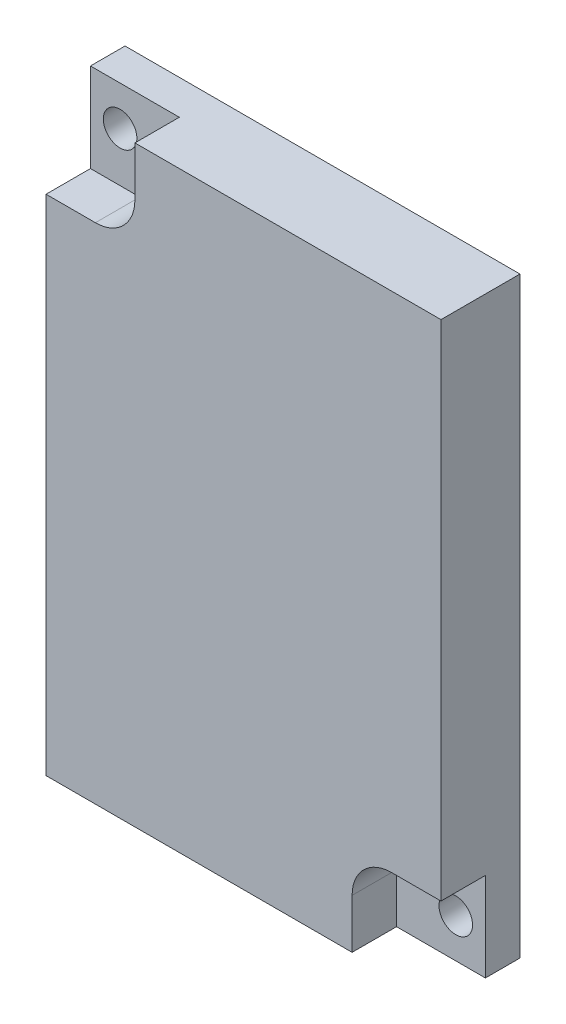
from build123d import *

# Parameters (mm, degrees)
ESQUISSE1_W             = 40
ESQUISSE1_H             = 60
EXTRUSION1_DEPTH        = 8
ESQUISSE2_W             = 9
ESQUISSE2_H             = 9
ENL_V_MAT_EXTRU_1_DEPTH = 4.5
D_GAGEMENT_M31_D        = 3.4
CONG_1_R                = 4


with BuildPart() as part:
    # Esquisse1 → Extrusion1 (new body)
    with BuildSketch(Plane.XY):
        with Locations((20, 30)):
            Rectangle(ESQUISSE1_W, ESQUISSE1_H)
    extrude(amount=EXTRUSION1_DEPTH)

    # Esquisse2 → Enl_v. mat.-Extru.1 (cut)
    with BuildSketch(Plane.XY.offset(8)):
        with Locations((4.5, 55.5)):
            Rectangle(ESQUISSE2_W, ESQUISSE2_H)
        with Locations((35.5, 4.5)):
            Rectangle(ESQUISSE2_W, ESQUISSE2_H)
    extrude(amount=-ENL_V_MAT_EXTRU_1_DEPTH, mode=Mode.SUBTRACT)

    # D_gagement M31 (through all)
    with Locations(Plane.XY.offset(3.5)):
        with Locations((3, 56), (37, 4)):
            Hole(D_GAGEMENT_M31_D / 2)

    # Cong_1
    cong_1_edges = [part.edges().sort_by_distance(p)[0] for p in [
        (9, 51, 5.75),
        (31, 9, 5.75),
    ]]
    fillet(cong_1_edges, radius=CONG_1_R)


solid = part.part
